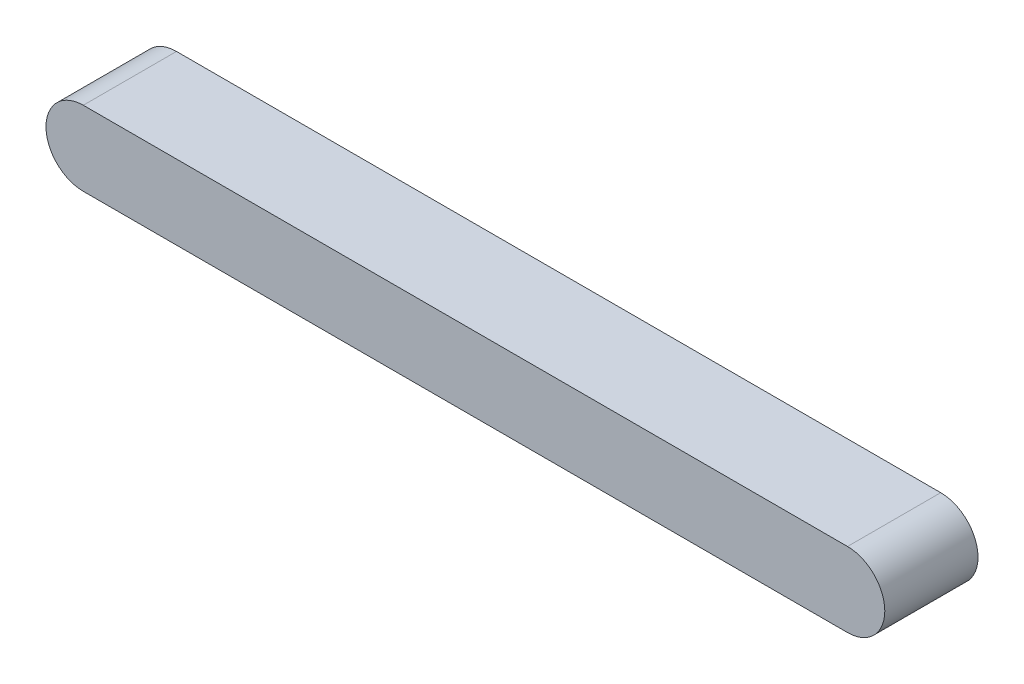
from build123d import *

# Parameters (mm, degrees)
LINEAR_AUSTRAGEN1_DEPTH = 5


with BuildPart() as part:
    # Skizze1 → Linear austragen1 (new body)
    with BuildSketch(Plane.XY):
        with BuildLine():
            Line((-20.5, -2), (20.5, -2))
            ThreePointArc((20.5, -2), (22.5, 0), (20.5, 2))
            Line((20.5, 2), (-20.5, 2))
            ThreePointArc((-20.5, 2), (-22.5, 0), (-20.5, -2))
        make_face()
    extrude(amount=-LINEAR_AUSTRAGEN1_DEPTH)


solid = part.part
